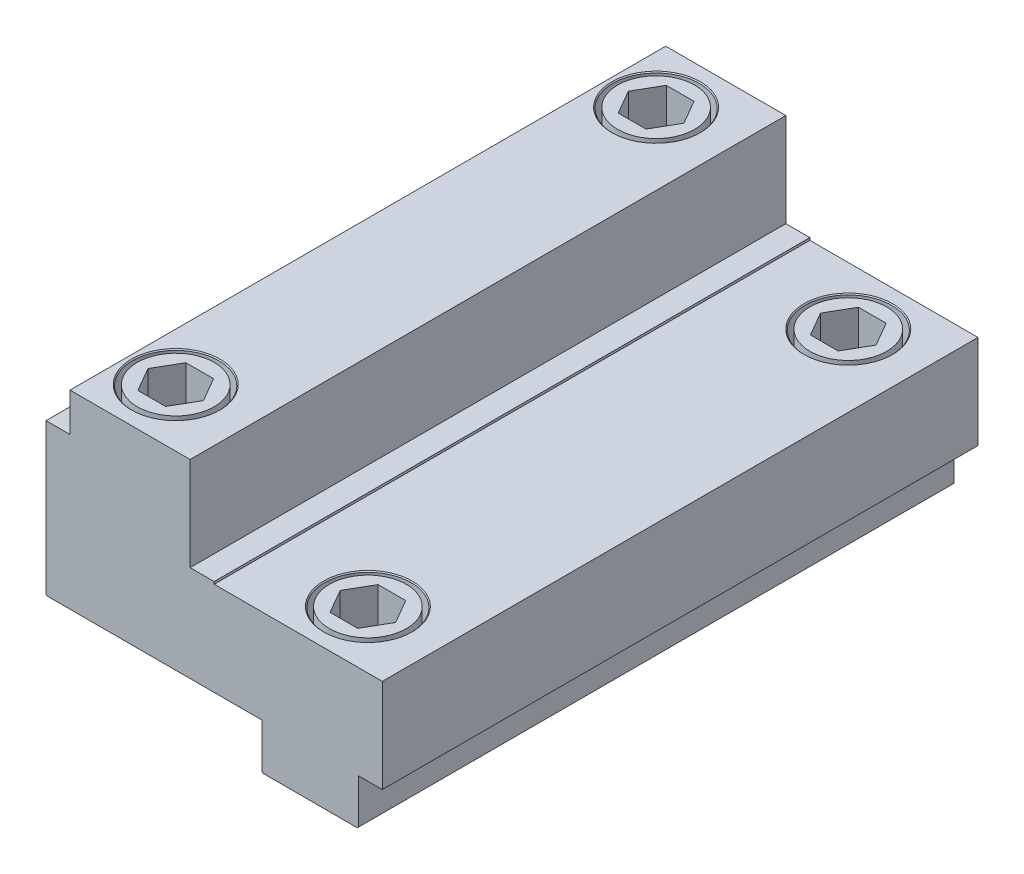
from build123d import *

# Parameters (mm, degrees)
BASIS_LINEAR_AUSTRAGEN_DEPTH         = 124
SCHNITT_LINEAR_AUSTRAGEN2_DEPTH      = 146.417502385
SCHNITT_LINEAR_AUSTRAGEN2_DEPTH_BACK = 146.417502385
SKIZZE2_R                            = 5.5
SKIZZE3_R                            = 9
SCHNITT_LINEAR_AUSTRAGEN3_DEPTH      = 10
SKIZZE5_R                            = 9
SCHNITT_LINEAR_AUSTRAGEN4_DEPTH      = 10
SKIZZE6_W                            = 35
SKIZZE6_H                            = 124
SCHNITT_LINEAR_AUSTRAGEN5_DEPTH      = 0.5
FASE10_SIZE                          = 0.2
SKIZZE7_R                            = 8
AUFSATZ_LINEAR_AUSTRAGEN1_DEPTH      = 10
SKIZZE8_R                            = 8
AUFSATZ_LINEAR_AUSTRAGEN3_DEPTH      = 9.5
AUFSATZ_LINEAR_START                 = -1
SKIZZE7_4_R                          = 8
AUFSATZ_LINEAR_AUSTRAGEN4_DEPTH      = 1
SKIZZE8_2_R                          = 8
AUFSATZ_LINEAR_AUSTRAGEN5_DEPTH      = 1


with BuildPart() as part:
    # Skizze1 → Basis-Linear austragen (new body)
    with BuildSketch(Plane.XY):
        Polygon((0, 0), (0, 31.5), (5, 31.5), (5, 39.5), (30, 39.5), (30, 20), (70, 20), (70, 0), (65, 0), (65, -9.5), (45, -9.5), (45, 0), align=None)
    extrude(amount=-BASIS_LINEAR_AUSTRAGEN_DEPTH)

    # Skizze2 → Schnitt-Linear austragen2 (cut, two sides: drawn at the far end of the back side and taken through both)
    with BuildSketch(Plane(origin=(0, 20, 0), x_dir=(-1, 0, 0), z_dir=(0, 1, 0)).offset(-SCHNITT_LINEAR_AUSTRAGEN2_DEPTH_BACK)):
        with Locations(Location((-55, -112, 0), (0, 0, 90))):
            Circle(SKIZZE2_R)
        with Locations(Location((-55, -12, 0), (0, 0, 90))):
            Circle(SKIZZE2_R)
        with Locations(Location((-15, -112, 0), (0, 0, 90))):
            Circle(SKIZZE2_R)
        with Locations(Location((-15, -12, 0), (0, 0, 90))):
            Circle(SKIZZE2_R)
    extrude(amount=SCHNITT_LINEAR_AUSTRAGEN2_DEPTH + SCHNITT_LINEAR_AUSTRAGEN2_DEPTH_BACK, mode=Mode.SUBTRACT)

    # Skizze3 → Schnitt-Linear austragen3 (cut)
    with BuildSketch(Plane(origin=(0, 20, 0), x_dir=(-1, 0, 0), z_dir=(0, 1, 0))):
        with Locations(Location((-55, -112, 0), (0, 0, 90))):
            Circle(SKIZZE3_R)
        with Locations(Location((-55, -12, 0), (0, 0, 90))):
            Circle(SKIZZE3_R)
    extrude(amount=-SCHNITT_LINEAR_AUSTRAGEN3_DEPTH, mode=Mode.SUBTRACT)

    # Skizze5 → Schnitt-Linear austragen4 (cut)
    with BuildSketch(Plane(origin=(0, 39.5, 0), x_dir=(-1, 0, 0), z_dir=(0, 1, 0))):
        with Locations(Location((-15, -112, 0), (0, 0, 90))):
            Circle(SKIZZE5_R)
        with Locations(Location((-15, -12, 0), (0, 0, 90))):
            Circle(SKIZZE5_R)
    extrude(amount=-SCHNITT_LINEAR_AUSTRAGEN4_DEPTH, mode=Mode.SUBTRACT)

    # Skizze6 → Schnitt-Linear austragen5 (cut)
    with BuildSketch(Plane(origin=(0, 20, 0), x_dir=(-1, 0, 0), z_dir=(0, 1, 0))):
        with Locations((-52.5, -62)):
            Rectangle(SKIZZE6_W, SKIZZE6_H)
    extrude(amount=-SCHNITT_LINEAR_AUSTRAGEN5_DEPTH, mode=Mode.SUBTRACT)

    # Fase10
    fase10_edges = [part.edges().sort_by_distance(p)[0] for p in [
        (0, 0, -62),
        (65, -9.5, -62),
        (45, -9.5, -62),
        (55, -9.5, -117.5),
        (55, -9.5, -17.5),
        (15, 0, -117.5),
        (15, 0, -17.5),
        (55, 10, -117.5),
        (55, 10, -17.5),
        (15, 39.5, -121),
        (15, 29.5, -117.5),
        (15, 39.5, -21),
        (15, 29.5, -17.5),
        (55, 19.5, -121),
        (55, 19.5, -21),
    ]]
    chamfer(fase10_edges, length=FASE10_SIZE)

    # Skizze7 → Aufsatz-Linear austragen1 (add)
    # profile 1 of 2: a face of its own
    with BuildSketch(Plane(origin=(0, 29.5, 29.5), x_dir=(0, 0, -1), z_dir=(0, 1, 0))):
        with Locations(Location((41.5, -15, 0), (0, 0, 90))):
            Circle(SKIZZE7_R)
        Polygon((41.5, -9.226497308), (36.5, -12.113248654), (36.5, -17.886751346), (41.5, -20.773502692), (46.5, -17.886751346), (46.5, -12.113248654), align=None, mode=Mode.SUBTRACT)
    # profile 2 of 2: a face of its own
    with BuildSketch(Plane(origin=(0, 29.5, 29.5), x_dir=(0, 0, -1), z_dir=(0, 1, 0))):
        with Locations(Location((141.5, -15, 0), (0, 0, 90))):
            Circle(SKIZZE7_R)
        Polygon((141.5, -9.226497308), (136.5, -12.113248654), (136.5, -17.886751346), (141.5, -20.773502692), (146.5, -17.886751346), (146.5, -12.113248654), align=None, mode=Mode.SUBTRACT)
    extrude(amount=AUFSATZ_LINEAR_AUSTRAGEN1_DEPTH)

    # Skizze8 → Aufsatz-Linear austragen3 (add)
    # profile 1 of 2: a face of its own
    with BuildSketch(Plane(origin=(0, 10, 0), x_dir=(1, 0, 0), z_dir=(0, 1, 0))):
        with Locations(Location((55, 112, 0), (0, 0, 270))):
            Circle(SKIZZE8_R)
        Polygon((60.773502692, 112), (57.886751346, 117), (52.113248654, 117), (49.226497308, 112), (52.113248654, 107), (57.886751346, 107), align=None, mode=Mode.SUBTRACT)
    # profile 2 of 2: a face of its own
    with BuildSketch(Plane(origin=(0, 10, 0), x_dir=(1, 0, 0), z_dir=(0, 1, 0))):
        with Locations(Location((55, 12, 0), (0, 0, 270))):
            Circle(SKIZZE8_R)
        Polygon((52.113248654, 17), (49.226497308, 12), (52.113248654, 7), (57.886751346, 7), (60.773502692, 12), (57.886751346, 17), align=None, mode=Mode.SUBTRACT)
    extrude(amount=AUFSATZ_LINEAR_AUSTRAGEN3_DEPTH)

    # Skizze7_4 → Aufsatz-Linear austragen4 (add)
    with BuildSketch(Plane(origin=(0, 29.5, 29.5), x_dir=(0, 0, -1), z_dir=(0, 1, 0)).offset(AUFSATZ_LINEAR_START)):
        with Locations(Location((41.5, -15, 0), (0, 0, 90))):
            Circle(SKIZZE7_4_R)
        with Locations(Location((141.5, -15, 0), (0, 0, 90))):
            Circle(SKIZZE7_4_R)
    extrude(amount=AUFSATZ_LINEAR_AUSTRAGEN4_DEPTH)

    # Skizze8_2 → Aufsatz-Linear austragen5 (add)
    with BuildSketch(Plane(origin=(0, 10, 0), x_dir=(1, 0, 0), z_dir=(0, 1, 0)).offset(AUFSATZ_LINEAR_START)):
        with Locations(Location((55, 112, 0), (0, 0, 270))):
            Circle(SKIZZE8_2_R)
        with Locations(Location((55, 12, 0), (0, 0, 270))):
            Circle(SKIZZE8_2_R)
    extrude(amount=AUFSATZ_LINEAR_AUSTRAGEN5_DEPTH)


solid = part.part
